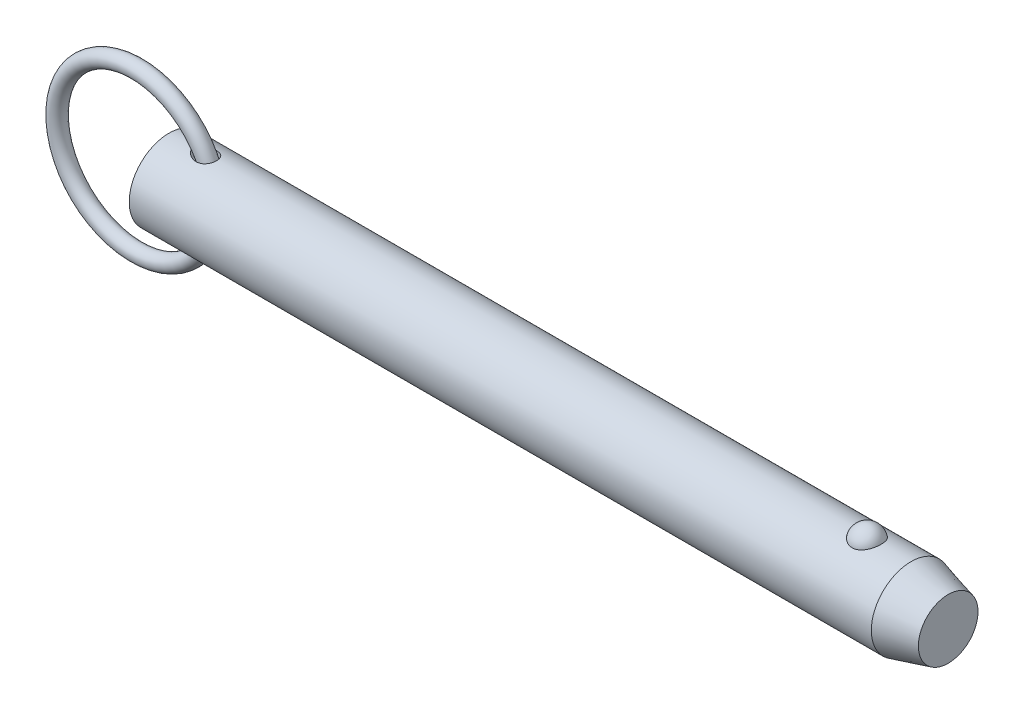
ISO-10303-21;
HEADER;
FILE_DESCRIPTION(('STEP AP214'),'2;1');
FILE_NAME('part.step','',(''),(''),'','','');
FILE_SCHEMA(('AUTOMOTIVE_DESIGN { 1 0 10303 214 1 1 1 1 }'));
ENDSEC;
DATA;
#1=APPLICATION_CONTEXT('core data for automotive mechanical design processes');
#2=APPLICATION_PROTOCOL_DEFINITION('international standard','automotive_design',2000,#1);
#3=PRODUCT_CONTEXT('',#1,'mechanical');
#4=PRODUCT('Part','Part','',(#3));
#5=PRODUCT_RELATED_PRODUCT_CATEGORY('part','',(#4));
#6=PRODUCT_DEFINITION_FORMATION('','',#4);
#7=PRODUCT_DEFINITION_CONTEXT('part definition',#1,'design');
#8=PRODUCT_DEFINITION('design','',#6,#7);
#9=PRODUCT_DEFINITION_SHAPE('','',#8);
#10=(LENGTH_UNIT() NAMED_UNIT(*) SI_UNIT(.MILLI.,.METRE.));
#11=(NAMED_UNIT(*) PLANE_ANGLE_UNIT() SI_UNIT($,.RADIAN.));
#12=(NAMED_UNIT(*) SI_UNIT($,.STERADIAN.) SOLID_ANGLE_UNIT());
#13=UNCERTAINTY_MEASURE_WITH_UNIT(LENGTH_MEASURE(1.E-05),#10,'distance_accuracy_value','');
#14=(GEOMETRIC_REPRESENTATION_CONTEXT(3) GLOBAL_UNCERTAINTY_ASSIGNED_CONTEXT((#13)) GLOBAL_UNIT_ASSIGNED_CONTEXT((#10,
#11,#12)) REPRESENTATION_CONTEXT('',''));
#15=CARTESIAN_POINT('',(0.,0.,0.));
#16=DIRECTION('',(0.,0.,1.));
#17=DIRECTION('',(1.,0.,0.));
#18=AXIS2_PLACEMENT_3D('',#15,#16,#17);
#19=CARTESIAN_POINT('',(-6.46799987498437,0.,0.));
#20=DIRECTION('',(0.,0.,1.));
#21=DIRECTION('',(1.,0.,0.));
#22=AXIS2_PLACEMENT_3D('',#19,#20,#21);
#23=TOROIDAL_SURFACE('',#22,15.875,1.588);
#24=CARTESIAN_POINT('',(10.9950001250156,0.,0.));
#25=VERTEX_POINT('',#24);
#26=VERTEX_LOOP('',#25);
#27=FACE_BOUND('',#26,.T.);
#28=ADVANCED_FACE('P0_F12',(#27),#23,.T.);
#29=CLOSED_SHELL('',(#28));
#30=MANIFOLD_SOLID_BREP('P0_B1',#29);
#31=CARTESIAN_POINT('',(0.,0.,0.));
#32=DIRECTION('',(1.,0.,0.));
#33=DIRECTION('',(0.,0.,-1.));
#34=AXIS2_PLACEMENT_3D('',#31,#32,#33);
#35=CYLINDRICAL_SURFACE('',#34,7.94);
#36=CARTESIAN_POINT('',(4.99454278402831,7.92831028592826,-0.430692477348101));
#37=CARTESIAN_POINT('',(5.02621962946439,7.92271974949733,-0.533554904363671));
#38=CARTESIAN_POINT('',(5.06869972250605,7.91528872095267,-0.633052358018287));
#39=CARTESIAN_POINT('',(5.17094751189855,7.89785690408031,-0.822566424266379));
#40=CARTESIAN_POINT('',(5.23077290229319,7.88784755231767,-0.912550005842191));
#41=CARTESIAN_POINT('',(5.37866013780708,7.8639674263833,-1.10117829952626));
#42=CARTESIAN_POINT('',(5.47004908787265,7.84973599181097,-1.19714712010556));
#43=CARTESIAN_POINT('',(5.66695490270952,7.82090787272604,-1.37293476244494));
#44=CARTESIAN_POINT('',(5.77247743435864,7.80631104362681,-1.45274707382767));
#45=CARTESIAN_POINT('',(5.99604254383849,7.77793596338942,-1.59776875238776));
#46=CARTESIAN_POINT('',(6.11428384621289,7.76417836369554,-1.66267404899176));
#47=CARTESIAN_POINT('',(6.35882685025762,7.73912410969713,-1.77564129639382));
#48=CARTESIAN_POINT('',(6.48513256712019,7.72782869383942,-1.82369477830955));
#49=CARTESIAN_POINT('',(6.76898453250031,7.70705630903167,-1.90977520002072));
#50=CARTESIAN_POINT('',(6.92778004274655,7.69837706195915,-1.94395681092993));
#51=CARTESIAN_POINT('',(7.24915504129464,7.6881294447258,-1.98412381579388));
#52=CARTESIAN_POINT('',(7.41173039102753,7.68655363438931,-1.99013871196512));
#53=CARTESIAN_POINT('',(7.697714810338,7.69094561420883,-1.97306069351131));
#54=CARTESIAN_POINT('',(7.82153338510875,7.69526202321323,-1.95634328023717));
#55=CARTESIAN_POINT('',(8.06460511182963,7.70859273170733,-1.90314615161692));
#56=CARTESIAN_POINT('',(8.18386164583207,7.7176034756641,-1.86668139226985));
#57=CARTESIAN_POINT('',(8.41450663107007,7.73959050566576,-1.77331230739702));
#58=CARTESIAN_POINT('',(8.52585042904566,7.75258738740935,-1.71630154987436));
#59=CARTESIAN_POINT('',(8.73575290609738,7.7809705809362,-1.58263416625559));
#60=CARTESIAN_POINT('',(8.83431445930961,7.7963563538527,-1.50598196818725));
#61=CARTESIAN_POINT('',(9.00639839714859,7.8259635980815,-1.34315626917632));
#62=CARTESIAN_POINT('',(9.08139772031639,7.84016008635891,-1.25853389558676));
#63=CARTESIAN_POINT('',(9.21545590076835,7.86710959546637,-1.07729126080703));
#64=CARTESIAN_POINT('',(9.27451869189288,7.87986297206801,-0.980673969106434));
#65=CARTESIAN_POINT('',(9.37315031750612,7.90198817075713,-0.782161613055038));
#66=CARTESIAN_POINT('',(9.41336512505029,7.91146854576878,-0.68059867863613));
#67=CARTESIAN_POINT('',(9.47650914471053,7.92664976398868,-0.471967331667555));
#68=CARTESIAN_POINT('',(9.49943917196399,7.93235078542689,-0.364899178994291));
#69=CARTESIAN_POINT('',(9.5274466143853,7.93934369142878,-0.14863226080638));
#70=CARTESIAN_POINT('',(9.53257574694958,7.9406483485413,-0.0394405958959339));
#71=CARTESIAN_POINT('',(9.52501411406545,7.93874464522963,0.178286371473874));
#72=CARTESIAN_POINT('',(9.51232314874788,7.93553623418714,0.286821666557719));
#73=CARTESIAN_POINT('',(9.46937875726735,7.92494527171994,0.500278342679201));
#74=CARTESIAN_POINT('',(9.43910562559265,7.9175580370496,0.605195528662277));
#75=CARTESIAN_POINT('',(9.36168926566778,7.8994090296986,0.808294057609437));
#76=CARTESIAN_POINT('',(9.3145467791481,7.88864740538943,0.906475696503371));
#77=CARTESIAN_POINT('',(9.20464679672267,7.86494645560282,1.09319438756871));
#78=CARTESIAN_POINT('',(9.14191093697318,7.85201015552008,1.18174456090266));
#79=CARTESIAN_POINT('',(9.00249124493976,7.82536913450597,1.34692675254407));
#80=CARTESIAN_POINT('',(8.92580850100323,7.81166447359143,1.42355969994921));
#81=CARTESIAN_POINT('',(8.76033130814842,7.78490157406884,1.56333296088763));
#82=CARTESIAN_POINT('',(8.67148512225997,7.77184644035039,1.62641250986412));
#83=CARTESIAN_POINT('',(8.48457694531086,7.74778101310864,1.73744892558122));
#84=CARTESIAN_POINT('',(8.38651410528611,7.73677090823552,1.78540439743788));
#85=CARTESIAN_POINT('',(8.18013312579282,7.71742695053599,1.86728938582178));
#86=CARTESIAN_POINT('',(8.07156725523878,7.7092102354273,1.90061897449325));
#87=CARTESIAN_POINT('',(7.85050876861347,7.6966502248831,1.95085652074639));
#88=CARTESIAN_POINT('',(7.73801453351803,7.69230854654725,1.967757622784));
#89=CARTESIAN_POINT('',(7.50002163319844,7.6873799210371,1.98693391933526));
#90=CARTESIAN_POINT('',(7.37438052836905,7.68722739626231,1.98751701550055));
#91=CARTESIAN_POINT('',(7.12435864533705,7.69142268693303,1.97121025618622));
#92=CARTESIAN_POINT('',(6.99997834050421,7.6957721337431,1.9543140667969));
#93=CARTESIAN_POINT('',(6.73521978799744,7.70925573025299,1.90049277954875));
#94=CARTESIAN_POINT('',(6.59543541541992,7.71903968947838,1.86081454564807));
#95=CARTESIAN_POINT('',(6.32319848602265,7.74233460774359,1.76138158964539));
#96=CARTESIAN_POINT('',(6.19076082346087,7.75585282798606,1.7015877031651));
#97=CARTESIAN_POINT('',(5.99269110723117,7.7785835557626,1.59336057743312));
#98=CARTESIAN_POINT('',(5.92332049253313,7.78707101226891,1.55151799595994));
#99=CARTESIAN_POINT('',(5.78862576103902,7.80440479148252,1.46183267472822));
#100=CARTESIAN_POINT('',(5.72330291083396,7.81325122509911,1.41398807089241));
#101=CARTESIAN_POINT('',(5.53492618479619,7.83980388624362,1.26162857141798));
#102=CARTESIAN_POINT('',(5.41884115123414,7.85759887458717,1.14795556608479));
#103=CARTESIAN_POINT('',(5.25731156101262,7.88350844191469,0.948390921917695));
#104=CARTESIAN_POINT('',(5.20241173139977,7.89260196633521,0.87019982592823));
#105=CARTESIAN_POINT('',(5.10541071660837,7.90897737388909,0.70602680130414));
#106=CARTESIAN_POINT('',(5.06329682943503,7.91626105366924,0.620052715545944));
#107=CARTESIAN_POINT('',(4.99458837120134,7.92827352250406,0.440665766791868));
#108=CARTESIAN_POINT('',(4.96816655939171,7.93297382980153,0.347182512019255));
#109=CARTESIAN_POINT('',(4.94275291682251,7.93751024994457,0.204498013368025));
#110=CARTESIAN_POINT('',(4.93665149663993,7.9386033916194,0.156529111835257));
#111=CARTESIAN_POINT('',(4.92932198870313,7.93991739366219,0.0602142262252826));
#112=CARTESIAN_POINT('',(4.92809242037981,7.94013851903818,0.011868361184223));
#113=CARTESIAN_POINT('',(4.93104052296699,7.93960920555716,-0.103241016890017));
#114=CARTESIAN_POINT('',(4.93747289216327,7.93845361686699,-0.169956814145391));
#115=CARTESIAN_POINT('',(4.95939910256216,7.93453812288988,-0.301777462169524));
#116=CARTESIAN_POINT('',(4.97489225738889,7.9317783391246,-0.36688243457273));
#117=CARTESIAN_POINT('',(4.99454278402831,7.92831028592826,-0.430692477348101));
#118=B_SPLINE_CURVE_WITH_KNOTS('',3,(#36,#37,#38,#39,#40,#41,#42,#43,#44,#45,#46,#47,#48,#49,
#50,#51,#52,#53,#54,#55,#56,#57,#58,#59,#60,#61,#62,#63,#64,#65,#66,#67,#68,#69,#70,#71,#72,#73,
#74,#75,#76,#77,#78,#79,#80,#81,#82,#83,#84,#85,#86,#87,#88,#89,#90,#91,#92,#93,#94,#95,#96,#97,
#98,#99,#100,#101,#102,#103,#104,#105,#106,#107,#108,#109,#110,#111,#112,#113,#114,#115,#116,
#117),.UNSPECIFIED.,.T.,.F.,(4,2,2,2,2,2,2,2,2,2,2,2,2,2,2,2,2,2,2,2,2,2,2,2,2,2,2,2,2,2,2,2,2,
2,2,2,2,2,2,2,4),(0.,0.323000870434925,0.647088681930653,1.04479679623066,1.4426648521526,
1.84804279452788,2.25362416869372,2.73917777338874,3.2242226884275,3.59772765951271,
3.97095014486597,4.34613445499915,4.72123425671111,5.06140749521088,5.40149668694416,
5.72887751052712,6.05624289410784,6.38265637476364,6.70907351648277,7.03585720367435,
7.36262652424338,7.68894495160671,8.01523792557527,8.34296459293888,8.67072147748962,
9.01089033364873,9.35120108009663,9.72668268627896,10.1023004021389,10.5375309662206,
10.9736138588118,11.2176803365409,11.461822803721,11.9480055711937,12.2349837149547,
12.5216758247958,12.8114683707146,12.9563497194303,13.1011870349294,13.3015737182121,
13.5019452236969),.UNSPECIFIED.);
#119=CARTESIAN_POINT('',(4.99454278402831,7.92831028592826,-0.430692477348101));
#120=VERTEX_POINT('',#119);
#121=EDGE_CURVE('P1_E40',#120,#120,#118,.T.);
#122=ORIENTED_EDGE('',*,*,#121,.T.);
#123=EDGE_LOOP('',(#122));
#124=FACE_BOUND('',#123,.T.);
#125=CARTESIAN_POINT('',(148.171879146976,0.,0.));
#126=DIRECTION('',(1.,0.,0.));
#127=DIRECTION('',(0.,0.,-1.));
#128=AXIS2_PLACEMENT_3D('',#125,#126,#127);
#129=CIRCLE('',#128,7.94);
#130=CARTESIAN_POINT('',(148.171879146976,0.,-7.94));
#131=VERTEX_POINT('',#130);
#132=EDGE_CURVE('P1_E25',#131,#131,#129,.T.);
#133=ORIENTED_EDGE('',*,*,#132,.F.);
#134=EDGE_LOOP('',(#133));
#135=FACE_BOUND('',#134,.T.);
#136=CARTESIAN_POINT('',(0.,0.,0.));
#137=DIRECTION('',(1.,0.,0.));
#138=DIRECTION('',(0.,0.,-1.));
#139=AXIS2_PLACEMENT_3D('',#136,#137,#138);
#140=CIRCLE('',#139,7.94);
#141=CARTESIAN_POINT('',(0.,0.,-7.94));
#142=VERTEX_POINT('',#141);
#143=EDGE_CURVE('P1_E9',#142,#142,#140,.T.);
#144=ORIENTED_EDGE('',*,*,#143,.T.);
#145=EDGE_LOOP('',(#144));
#146=FACE_BOUND('',#145,.T.);
#147=CARTESIAN_POINT('',(139.364907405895,7.37767842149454,2.93486986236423));
#148=CARTESIAN_POINT('',(139.212749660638,7.3776732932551,2.93487505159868));
#149=CARTESIAN_POINT('',(139.060632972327,7.38258419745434,2.92262454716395));
#150=CARTESIAN_POINT('',(138.760928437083,7.40163229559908,2.87404196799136));
#151=CARTESIAN_POINT('',(138.613339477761,7.41576720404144,2.83771585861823));
#152=CARTESIAN_POINT('',(138.327018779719,7.4516157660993,2.74218769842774));
#153=CARTESIAN_POINT('',(138.188274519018,7.47331841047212,2.68301886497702));
#154=CARTESIAN_POINT('',(137.922882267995,7.52194082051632,2.54350967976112));
#155=CARTESIAN_POINT('',(137.796236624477,7.54886159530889,2.46316523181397));
#156=CARTESIAN_POINT('',(137.554534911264,7.60594671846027,2.28090375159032));
#157=CARTESIAN_POINT('',(137.439906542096,7.63618114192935,2.1784421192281));
#158=CARTESIAN_POINT('',(137.228878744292,7.69614046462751,1.95608495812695));
#159=CARTESIAN_POINT('',(137.132482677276,7.72586526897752,1.83618622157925));
#160=CARTESIAN_POINT('',(136.955938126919,7.78314821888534,1.57628086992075));
#161=CARTESIAN_POINT('',(136.876707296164,7.81055035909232,1.43561546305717));
#162=CARTESIAN_POINT('',(136.741797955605,7.85879631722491,1.142363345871));
#163=CARTESIAN_POINT('',(136.686121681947,7.87963951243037,0.989775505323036));
#164=CARTESIAN_POINT('',(136.59881215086,7.91289645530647,0.674619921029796));
#165=CARTESIAN_POINT('',(136.56753090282,7.92518652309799,0.511941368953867));
#166=CARTESIAN_POINT('',(136.530975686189,7.93958930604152,0.183247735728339));
#167=CARTESIAN_POINT('',(136.525701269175,7.94170219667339,0.0172327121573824));
#168=CARTESIAN_POINT('',(136.541231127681,7.93554931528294,-0.312672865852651));
#169=CARTESIAN_POINT('',(136.561925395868,7.92732732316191,-0.476569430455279));
#170=CARTESIAN_POINT('',(136.62878655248,7.90141534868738,-0.798305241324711));
#171=CARTESIAN_POINT('',(136.674953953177,7.88372517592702,-0.956144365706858));
#172=CARTESIAN_POINT('',(136.791898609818,7.84066230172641,-1.26152073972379));
#173=CARTESIAN_POINT('',(136.862704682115,7.81528060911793,-1.40904568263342));
#174=CARTESIAN_POINT('',(137.027478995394,7.75948672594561,-1.68950598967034));
#175=CARTESIAN_POINT('',(137.121448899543,7.72907417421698,-1.82244030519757));
#176=CARTESIAN_POINT('',(137.330839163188,7.66640424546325,-2.07032792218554));
#177=CARTESIAN_POINT('',(137.446315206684,7.63414223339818,-2.18523308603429));
#178=CARTESIAN_POINT('',(137.6959006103,7.57149681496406,-2.39329737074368));
#179=CARTESIAN_POINT('',(137.830008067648,7.54111321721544,-2.48645870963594));
#180=CARTESIAN_POINT('',(138.110111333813,7.48650742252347,-2.64628132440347));
#181=CARTESIAN_POINT('',(138.255760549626,7.46215900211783,-2.71350554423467));
#182=CARTESIAN_POINT('',(138.557425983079,7.42171253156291,-2.82226614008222));
#183=CARTESIAN_POINT('',(138.713438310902,7.40561140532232,-2.86381209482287));
#184=CARTESIAN_POINT('',(139.022970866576,7.3842679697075,-2.9183907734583));
#185=CARTESIAN_POINT('',(139.176222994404,7.37852109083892,-2.93275024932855));
#186=CARTESIAN_POINT('',(139.483070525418,7.37700973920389,-2.93655208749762));
#187=CARTESIAN_POINT('',(139.636665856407,7.38124333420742,-2.92599927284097));
#188=CARTESIAN_POINT('',(139.934990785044,7.39890635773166,-2.88102897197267));
#189=CARTESIAN_POINT('',(140.079848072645,7.41205491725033,-2.84733999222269));
#190=CARTESIAN_POINT('',(140.36164329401,7.445801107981,-2.75788206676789));
#191=CARTESIAN_POINT('',(140.498580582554,7.46639934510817,-2.70211132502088));
#192=CARTESIAN_POINT('',(140.764061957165,7.51339098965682,-2.56858908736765));
#193=CARTESIAN_POINT('',(140.892354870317,7.53990200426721,-2.4903806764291));
#194=CARTESIAN_POINT('',(141.134244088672,7.59569503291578,-2.31462737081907));
#195=CARTESIAN_POINT('',(141.247837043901,7.6249776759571,-2.21707808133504));
#196=CARTESIAN_POINT('',(141.46322156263,7.68489473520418,-1.99982049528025));
#197=CARTESIAN_POINT('',(141.564148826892,7.71552419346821,-1.87925337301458));
#198=CARTESIAN_POINT('',(141.745186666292,7.77353016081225,-1.6226882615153));
#199=CARTESIAN_POINT('',(141.825293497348,7.80090608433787,-1.48668750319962));
#200=CARTESIAN_POINT('',(141.965361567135,7.85047992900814,-1.1981841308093));
#201=CARTESIAN_POINT('',(142.024587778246,7.87248183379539,-1.04529016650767));
#202=CARTESIAN_POINT('',(142.117982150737,7.90785114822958,-0.731080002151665));
#203=CARTESIAN_POINT('',(142.152149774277,7.92121837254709,-0.569763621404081));
#204=CARTESIAN_POINT('',(142.194795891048,7.93797834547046,-0.242812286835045));
#205=CARTESIAN_POINT('',(142.203204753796,7.94134405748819,-0.0771668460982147));
#206=CARTESIAN_POINT('',(142.193962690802,7.93767937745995,0.253276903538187));
#207=CARTESIAN_POINT('',(142.176312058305,7.93064910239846,0.418075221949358));
#208=CARTESIAN_POINT('',(142.115424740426,7.90695571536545,0.741525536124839));
#209=CARTESIAN_POINT('',(142.072281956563,7.8903279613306,0.900197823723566));
#210=CARTESIAN_POINT('',(141.96135358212,7.84916386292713,1.20759654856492));
#211=CARTESIAN_POINT('',(141.89356656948,7.82462706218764,1.35632241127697));
#212=CARTESIAN_POINT('',(141.734371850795,7.77006699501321,1.64032869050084));
#213=CARTESIAN_POINT('',(141.642861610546,7.74002008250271,1.7755471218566));
#214=CARTESIAN_POINT('',(141.438296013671,7.67774175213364,2.0280064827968));
#215=CARTESIAN_POINT('',(141.325241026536,7.64551037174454,2.14524772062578));
#216=CARTESIAN_POINT('',(141.080831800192,7.58265895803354,2.35778002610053));
#217=CARTESIAN_POINT('',(140.949583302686,7.5520309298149,2.45319004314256));
#218=CARTESIAN_POINT('',(140.671601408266,7.49579792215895,2.61999897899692));
#219=CARTESIAN_POINT('',(140.524867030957,7.47019326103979,2.69139637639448));
#220=CARTESIAN_POINT('',(140.212947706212,7.42622216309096,2.8105324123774));
#221=CARTESIAN_POINT('',(140.047220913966,7.40825002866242,2.85700910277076));
#222=CARTESIAN_POINT('',(139.709279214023,7.38398348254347,2.9191685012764));
#223=CARTESIAN_POINT('',(139.53706702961,7.3776842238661,2.93486399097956));
#224=CARTESIAN_POINT('',(139.364907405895,7.37767842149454,2.93486986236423));
#225=B_SPLINE_CURVE_WITH_KNOTS('',3,(#147,#148,#149,#150,#151,#152,#153,#154,#155,#156,#157,
#158,#159,#160,#161,#162,#163,#164,#165,#166,#167,#168,#169,#170,#171,#172,#173,#174,#175,#176,
#177,#178,#179,#180,#181,#182,#183,#184,#185,#186,#187,#188,#189,#190,#191,#192,#193,#194,#195,
#196,#197,#198,#199,#200,#201,#202,#203,#204,#205,#206,#207,#208,#209,#210,#211,#212,#213,#214,
#215,#216,#217,#218,#219,#220,#221,#222,#223,#224),.UNSPECIFIED.,.T.,.F.,(4,2,2,2,2,2,2,2,2,2,2,
2,2,2,2,2,2,2,2,2,2,2,2,2,2,2,2,2,2,2,2,2,2,2,2,2,2,2,4),(0.,0.455841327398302,
0.911569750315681,1.36663794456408,1.82179423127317,2.2897898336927,2.75787163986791,
3.24685368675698,3.73588214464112,4.23184282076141,4.72779494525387,5.22165321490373,
5.71552141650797,6.20996917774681,6.7044524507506,7.20023431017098,7.69596557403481,
8.18023418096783,8.66432203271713,9.12410697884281,9.58380291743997,10.0296503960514,
10.4755341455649,10.9312349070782,11.3870393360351,11.8654416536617,12.3439299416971,
12.8378875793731,13.3318558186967,13.8271581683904,14.3224549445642,14.8159385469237,
15.3094506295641,15.8051323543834,16.3008055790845,16.7937101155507,17.2866458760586,
17.8026240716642,18.3183879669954),.UNSPECIFIED.);
#226=CARTESIAN_POINT('',(139.364907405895,7.37767842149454,2.93486986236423));
#227=VERTEX_POINT('',#226);
#228=EDGE_CURVE('P1_E34',#227,#227,#225,.T.);
#229=ORIENTED_EDGE('',*,*,#228,.T.);
#230=EDGE_LOOP('',(#229));
#231=FACE_BOUND('',#230,.T.);
#232=CARTESIAN_POINT('',(4.99454278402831,-7.92831028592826,-0.430692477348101));
#233=CARTESIAN_POINT('',(4.97033227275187,-7.93258231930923,-0.352006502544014));
#234=CARTESIAN_POINT('',(4.95238785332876,-7.93578782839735,-0.271213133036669));
#235=CARTESIAN_POINT('',(4.93055628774,-7.93969351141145,-0.107590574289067));
#236=CARTESIAN_POINT('',(4.92668686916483,-7.9403905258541,-0.0247589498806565));
#237=CARTESIAN_POINT('',(4.9333808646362,-7.93918950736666,0.140249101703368));
#238=CARTESIAN_POINT('',(4.94393526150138,-7.93729309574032,0.222425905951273));
#239=CARTESIAN_POINT('',(4.97854187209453,-7.93113325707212,0.383746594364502));
#240=CARTESIAN_POINT('',(5.00259804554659,-7.92686913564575,0.462889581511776));
#241=CARTESIAN_POINT('',(5.06904511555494,-7.91526143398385,0.633278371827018));
#242=CARTESIAN_POINT('',(5.11430124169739,-7.90744739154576,0.723368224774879));
#243=CARTESIAN_POINT('',(5.21873327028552,-7.88988375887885,0.894880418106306));
#244=CARTESIAN_POINT('',(5.27793532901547,-7.88013053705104,0.976286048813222));
#245=CARTESIAN_POINT('',(5.42949971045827,-7.85602233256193,1.15646341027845));
#246=CARTESIAN_POINT('',(5.52624420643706,-7.84124381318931,1.25147911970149));
#247=CARTESIAN_POINT('',(5.73364751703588,-7.81163164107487,1.42469165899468));
#248=CARTESIAN_POINT('',(5.84432059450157,-7.79679794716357,1.50287102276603));
#249=CARTESIAN_POINT('',(6.07871104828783,-7.76824211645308,1.64418004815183));
#250=CARTESIAN_POINT('',(6.20267992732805,-7.75455572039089,1.70689813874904));
#251=CARTESIAN_POINT('',(6.45850163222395,-7.73013259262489,1.81429879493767));
#252=CARTESIAN_POINT('',(6.59035778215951,-7.71939711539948,1.85897369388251));
#253=CARTESIAN_POINT('',(6.88209177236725,-7.70072462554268,1.93500734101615));
#254=CARTESIAN_POINT('',(7.04295460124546,-7.69356120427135,1.96286607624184));
#255=CARTESIAN_POINT('',(7.36724421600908,-7.68676336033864,1.98935053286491));
#256=CARTESIAN_POINT('',(7.53066723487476,-7.68711875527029,1.98801578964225));
#257=CARTESIAN_POINT('',(7.81370255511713,-7.69496475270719,1.95735673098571));
#258=CARTESIAN_POINT('',(7.93413357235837,-7.70066491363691,1.93505220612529));
#259=CARTESIAN_POINT('',(8.16950597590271,-7.71642704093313,1.87121573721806));
#260=CARTESIAN_POINT('',(8.28445128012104,-7.72648584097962,1.82969774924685));
#261=CARTESIAN_POINT('',(8.50557964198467,-7.75006886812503,1.72707806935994));
#262=CARTESIAN_POINT('',(8.61171927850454,-7.76360905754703,1.66588583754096));
#263=CARTESIAN_POINT('',(8.810712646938,-7.79249659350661,1.52503518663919));
#264=CARTESIAN_POINT('',(8.90356827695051,-7.80784368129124,1.44537941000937));
#265=CARTESIAN_POINT('',(9.06550151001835,-7.83702302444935,1.27723027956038));
#266=CARTESIAN_POINT('',(9.1359139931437,-7.85087516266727,1.19002179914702));
#267=CARTESIAN_POINT('',(9.26060432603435,-7.87675706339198,1.00451336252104));
#268=CARTESIAN_POINT('',(9.31488561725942,-7.88878721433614,0.906215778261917));
#269=CARTESIAN_POINT('',(9.40446618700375,-7.90930761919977,0.70456335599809));
#270=CARTESIAN_POINT('',(9.44028687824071,-7.91789338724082,0.601449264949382));
#271=CARTESIAN_POINT('',(9.49451523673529,-7.93109531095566,0.390496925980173));
#272=CARTESIAN_POINT('',(9.51292345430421,-7.93571159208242,0.282658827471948));
#273=CARTESIAN_POINT('',(9.53189686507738,-7.94047189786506,0.0654759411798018));
#274=CARTESIAN_POINT('',(9.53248611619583,-7.94062195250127,-0.0438666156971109));
#275=CARTESIAN_POINT('',(9.51587068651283,-7.93644929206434,-0.26110665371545));
#276=CARTESIAN_POINT('',(9.49866585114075,-7.93212653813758,-0.369004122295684));
#277=CARTESIAN_POINT('',(9.44682594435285,-7.91946859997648,-0.58038072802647));
#278=CARTESIAN_POINT('',(9.412176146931,-7.91113002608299,-0.683856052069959));
#279=CARTESIAN_POINT('',(9.32626198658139,-7.89134774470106,-0.883337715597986));
#280=CARTESIAN_POINT('',(9.27499851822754,-7.87990420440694,-0.979344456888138));
#281=CARTESIAN_POINT('',(9.15725058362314,-7.8551872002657,-1.1610523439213));
#282=CARTESIAN_POINT('',(9.09078836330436,-7.84191642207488,-1.24676827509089));
#283=CARTESIAN_POINT('',(8.94443523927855,-7.81498501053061,-1.40574704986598));
#284=CARTESIAN_POINT('',(8.86454527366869,-7.80132440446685,-1.47901076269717));
#285=CARTESIAN_POINT('',(8.69307774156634,-7.77497848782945,-1.61181253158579));
#286=CARTESIAN_POINT('',(8.60142539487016,-7.76230033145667,-1.67125525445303));
#287=CARTESIAN_POINT('',(8.40957687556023,-7.73928987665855,-1.77477159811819));
#288=CARTESIAN_POINT('',(8.30937953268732,-7.72895790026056,-1.81884310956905));
#289=CARTESIAN_POINT('',(8.0986350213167,-7.71113842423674,-1.89300673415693));
#290=CARTESIAN_POINT('',(7.98782526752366,-7.70379913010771,-1.92238394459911));
#291=CARTESIAN_POINT('',(7.76294389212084,-7.69313871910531,-1.96460780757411));
#292=CARTESIAN_POINT('',(7.64887102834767,-7.68981915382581,-1.9774480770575));
#293=CARTESIAN_POINT('',(7.40716929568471,-7.68706358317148,-1.98813881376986));
#294=CARTESIAN_POINT('',(7.27945620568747,-7.68810537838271,-1.98414471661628));
#295=CARTESIAN_POINT('',(7.02593945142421,-7.6946815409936,-1.95847707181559));
#296=CARTESIAN_POINT('',(6.90013720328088,-7.7002190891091,-1.93679100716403));
#297=CARTESIAN_POINT('',(6.63265145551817,-7.71617635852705,-1.87230070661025));
#298=CARTESIAN_POINT('',(6.49169161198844,-7.72724102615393,-1.82664736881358));
#299=CARTESIAN_POINT('',(6.21840602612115,-7.75282261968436,-1.71482542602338));
#300=CARTESIAN_POINT('',(6.08608498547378,-7.76734140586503,-1.64864576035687));
#301=CARTESIAN_POINT('',(5.84453114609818,-7.7967744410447,-1.50297952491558));
#302=CARTESIAN_POINT('',(5.73429128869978,-7.81154606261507,-1.4251373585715));
#303=CARTESIAN_POINT('',(5.52761180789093,-7.84104229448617,-1.25271210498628));
#304=CARTESIAN_POINT('',(5.43116004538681,-7.85576693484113,-1.15814390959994));
#305=CARTESIAN_POINT('',(5.27970568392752,-7.87984260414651,-0.978603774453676));
#306=CARTESIAN_POINT('',(5.22040249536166,-7.88960721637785,-0.897319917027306));
#307=CARTESIAN_POINT('',(5.11583115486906,-7.90718602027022,-0.726171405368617));
#308=CARTESIAN_POINT('',(5.07050564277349,-7.9150081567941,-0.636343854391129));
#309=CARTESIAN_POINT('',(5.01937588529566,-7.92393751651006,-0.506165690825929));
#310=CARTESIAN_POINT('',(5.00622932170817,-7.926248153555,-0.468674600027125));
#311=CARTESIAN_POINT('',(4.99454278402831,-7.92831028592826,-0.430692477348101));
#312=B_SPLINE_CURVE_WITH_KNOTS('',3,(#232,#233,#234,#235,#236,#237,#238,#239,#240,#241,#242,
#243,#244,#245,#246,#247,#248,#249,#250,#251,#252,#253,#254,#255,#256,#257,#258,#259,#260,#261,
#262,#263,#264,#265,#266,#267,#268,#269,#270,#271,#272,#273,#274,#275,#276,#277,#278,#279,#280,
#281,#282,#283,#284,#285,#286,#287,#288,#289,#290,#291,#292,#293,#294,#295,#296,#297,#298,#299,
#300,#301,#302,#303,#304,#305,#306,#307,#308,#309,#310,#311),.UNSPECIFIED.,.T.,.F.,(4,2,2,2,2,2,
2,2,2,2,2,2,2,2,2,2,2,2,2,2,2,2,2,2,2,2,2,2,2,2,2,2,2,2,2,2,2,2,2,4),(0.,0.247186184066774,
0.494683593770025,0.742026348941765,0.989441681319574,1.29115800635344,1.59344478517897,
2.00047108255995,2.40791761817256,2.82525860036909,3.2427767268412,3.7304673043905,
4.21749746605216,4.58380730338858,4.94985148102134,5.31760488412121,5.68530568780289,
6.02244390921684,6.35951015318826,6.68644714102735,7.01337379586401,7.33985903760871,
7.66634711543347,7.9931112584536,8.31985780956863,8.64612913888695,8.97237768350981,
9.30081392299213,9.62929521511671,9.9724956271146,10.3158284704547,10.6977037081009,
11.0798493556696,11.523823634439,11.9680375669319,12.3738595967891,12.7793221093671,
13.0815405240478,13.3825016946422,13.5018197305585),.UNSPECIFIED.);
#313=CARTESIAN_POINT('',(4.99454278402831,-7.92831028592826,-0.430692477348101));
#314=VERTEX_POINT('',#313);
#315=EDGE_CURVE('P1_E17',#314,#314,#312,.T.);
#316=ORIENTED_EDGE('',*,*,#315,.T.);
#317=EDGE_LOOP('',(#316));
#318=FACE_BOUND('',#317,.T.);
#319=ADVANCED_FACE('P1_F13',(#124,#135,#146,#231,#318),#35,.T.);
#320=CARTESIAN_POINT('',(0.,0.,0.));
#321=DIRECTION('',(-1.,0.,0.));
#322=DIRECTION('',(0.,0.,1.));
#323=AXIS2_PLACEMENT_3D('',#320,#321,#322);
#324=PLANE('',#323);
#325=ORIENTED_EDGE('',*,*,#143,.F.);
#326=EDGE_LOOP('',(#325));
#327=FACE_BOUND('',#326,.T.);
#328=ADVANCED_FACE('P1_F15',(#327),#324,.T.);
#329=CARTESIAN_POINT('',(155.58,0.,0.));
#330=DIRECTION('',(-1.,0.,0.));
#331=DIRECTION('',(0.,0.,1.));
#332=AXIS2_PLACEMENT_3D('',#329,#330,#331);
#333=CONICAL_SURFACE('',#332,5.95500000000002,0.26179938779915);
#334=ORIENTED_EDGE('',*,*,#132,.T.);
#335=EDGE_LOOP('',(#334));
#336=FACE_BOUND('',#335,.T.);
#337=CARTESIAN_POINT('',(155.58,0.,0.));
#338=DIRECTION('',(1.,0.,0.));
#339=DIRECTION('',(0.,0.,-1.));
#340=AXIS2_PLACEMENT_3D('',#337,#338,#339);
#341=CIRCLE('',#340,5.95500000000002);
#342=CARTESIAN_POINT('',(155.58,0.,-5.95500000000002));
#343=VERTEX_POINT('',#342);
#344=EDGE_CURVE('P1_E30',#343,#343,#341,.T.);
#345=ORIENTED_EDGE('',*,*,#344,.F.);
#346=EDGE_LOOP('',(#345));
#347=FACE_BOUND('',#346,.T.);
#348=ADVANCED_FACE('P1_F55',(#336,#347),#333,.T.);
#349=CARTESIAN_POINT('',(155.58,5.95500000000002,0.));
#350=DIRECTION('',(1.,0.,0.));
#351=DIRECTION('',(0.,0.,-1.));
#352=AXIS2_PLACEMENT_3D('',#349,#350,#351);
#353=PLANE('',#352);
#354=ORIENTED_EDGE('',*,*,#344,.T.);
#355=EDGE_LOOP('',(#354));
#356=FACE_BOUND('',#355,.T.);
#357=ADVANCED_FACE('P1_F51',(#356),#353,.T.);
#358=CARTESIAN_POINT('',(139.364907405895,7.146,0.));
#359=DIRECTION('',(-1.,0.,0.));
#360=DIRECTION('',(0.,-1.,0.));
#361=AXIS2_PLACEMENT_3D('',#358,#359,#360);
#362=SPHERICAL_SURFACE('',#361,2.944);
#363=ORIENTED_EDGE('',*,*,#228,.F.);
#364=EDGE_LOOP('',(#363));
#365=FACE_BOUND('',#364,.T.);
#366=ADVANCED_FACE('P1_F46',(#365),#362,.T.);
#367=CARTESIAN_POINT('',(-6.46799987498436,0.,0.));
#368=DIRECTION('',(0.,0.,1.));
#369=DIRECTION('',(1.,0.,0.));
#370=AXIS2_PLACEMENT_3D('',#367,#368,#369);
#371=TOROIDAL_SURFACE('',#370,15.875,1.985);
#372=ORIENTED_EDGE('',*,*,#315,.F.);
#373=EDGE_LOOP('',(#372));
#374=FACE_BOUND('',#373,.T.);
#375=ORIENTED_EDGE('',*,*,#121,.F.);
#376=EDGE_LOOP('',(#375));
#377=FACE_BOUND('',#376,.T.);
#378=ADVANCED_FACE('P1_F50',(#374,#377),#371,.F.);
#379=CLOSED_SHELL('',(#319,#328,#348,#357,#366,#378));
#380=MANIFOLD_SOLID_BREP('P1_B1',#379);
#381=ADVANCED_BREP_SHAPE_REPRESENTATION('',(#18,#30,#380),#14);
#382=SHAPE_DEFINITION_REPRESENTATION(#9,#381);
ENDSEC;
END-ISO-10303-21;
